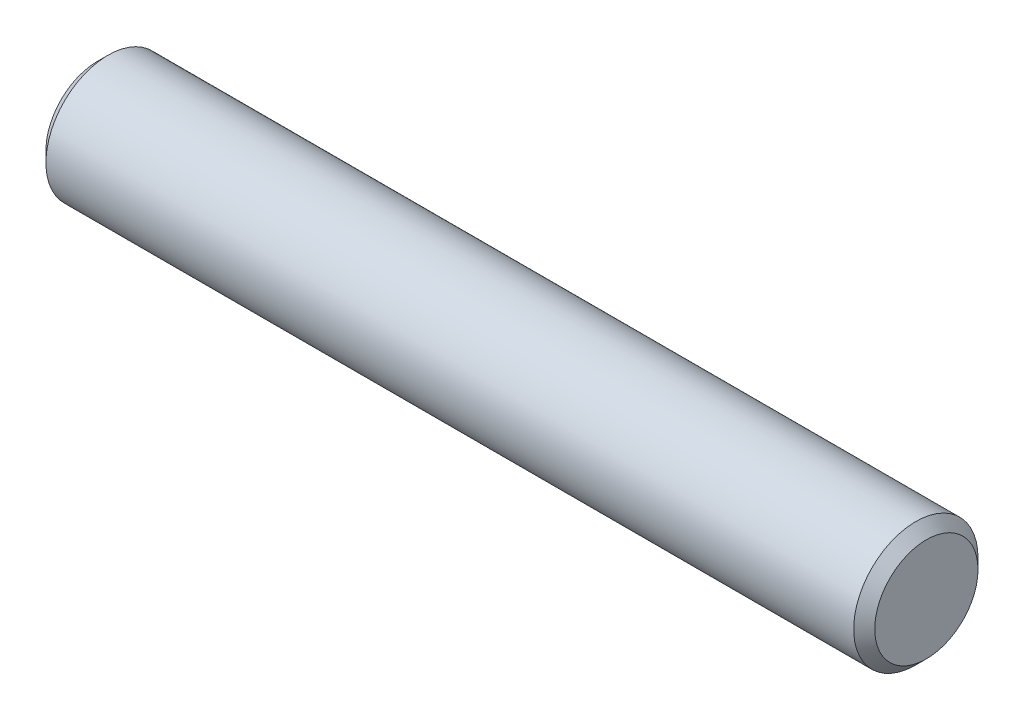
from build123d import *

# Parameters (mm, degrees)
XSECTION_R      = 1.5
EXTRUSION_DEPTH = 10
CHAMFER1_SIZE   = 0.254


with BuildPart() as part:
    # xsection → extrusion (new, symmetric)
    with BuildSketch(Plane(origin=(0, 0, 0), x_dir=(0, 0, -1), z_dir=(1, 0, 0))):
        Circle(XSECTION_R)
    extrude(amount=EXTRUSION_DEPTH, both=True)

    # Chamfer1
    chamfer1_edges = [part.edges().sort_by_distance(p)[0] for p in [
        (-10, 0, 1.5),
        (10, 0, 1.5),
    ]]
    chamfer(chamfer1_edges, length=CHAMFER1_SIZE)


solid = part.part
